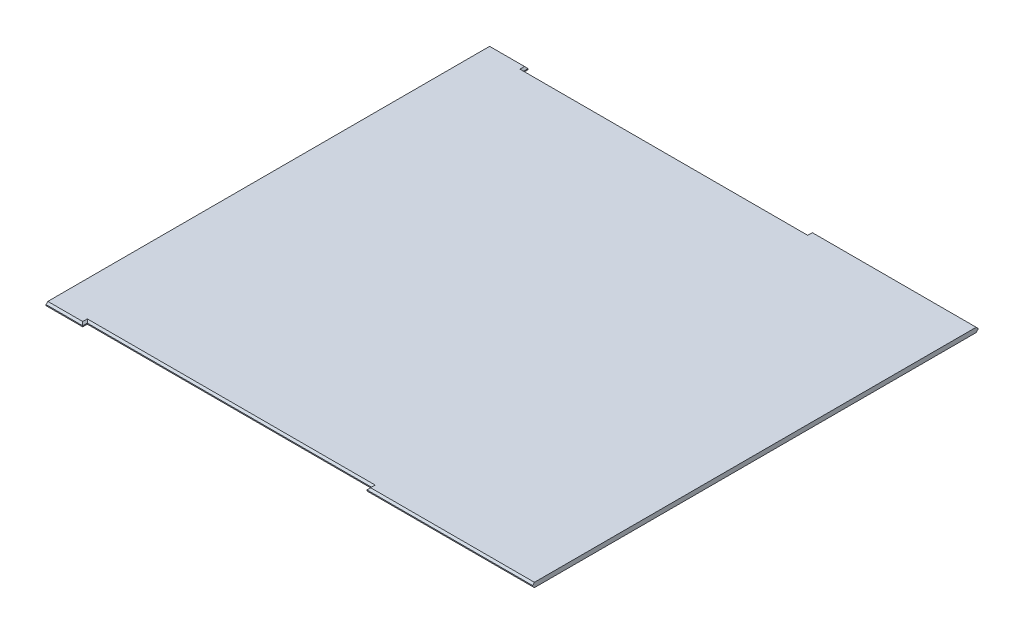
ISO-10303-21;
HEADER;
FILE_DESCRIPTION(('STEP AP214'),'2;1');
FILE_NAME('part.step','',(''),(''),'','','');
FILE_SCHEMA(('AUTOMOTIVE_DESIGN { 1 0 10303 214 1 1 1 1 }'));
ENDSEC;
DATA;
#1=APPLICATION_CONTEXT('core data for automotive mechanical design processes');
#2=APPLICATION_PROTOCOL_DEFINITION('international standard','automotive_design',2000,#1);
#3=PRODUCT_CONTEXT('',#1,'mechanical');
#4=PRODUCT('Part','Part','',(#3));
#5=PRODUCT_RELATED_PRODUCT_CATEGORY('part','',(#4));
#6=PRODUCT_DEFINITION_FORMATION('','',#4);
#7=PRODUCT_DEFINITION_CONTEXT('part definition',#1,'design');
#8=PRODUCT_DEFINITION('design','',#6,#7);
#9=PRODUCT_DEFINITION_SHAPE('','',#8);
#10=(LENGTH_UNIT() NAMED_UNIT(*) SI_UNIT(.MILLI.,.METRE.));
#11=(NAMED_UNIT(*) PLANE_ANGLE_UNIT() SI_UNIT($,.RADIAN.));
#12=(NAMED_UNIT(*) SI_UNIT($,.STERADIAN.) SOLID_ANGLE_UNIT());
#13=UNCERTAINTY_MEASURE_WITH_UNIT(LENGTH_MEASURE(1.E-05),#10,'distance_accuracy_value','');
#14=(GEOMETRIC_REPRESENTATION_CONTEXT(3) GLOBAL_UNCERTAINTY_ASSIGNED_CONTEXT((#13)) GLOBAL_UNIT_ASSIGNED_CONTEXT((#10,
#11,#12)) REPRESENTATION_CONTEXT('',''));
#15=CARTESIAN_POINT('',(0.,0.,0.));
#16=DIRECTION('',(0.,0.,1.));
#17=DIRECTION('',(1.,0.,0.));
#18=AXIS2_PLACEMENT_3D('',#15,#16,#17);
#19=CARTESIAN_POINT('',(-562.573544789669,6.35,-556.126720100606));
#20=DIRECTION('',(-1.,0.,0.));
#21=DIRECTION('',(0.,0.,1.));
#22=AXIS2_PLACEMENT_3D('',#19,#20,#21);
#23=PLANE('',#22);
#24=DIRECTION('',(0.,-1.,0.));
#25=VECTOR('',#24,1.);
#26=CARTESIAN_POINT('',(-562.573544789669,6.35,-556.126720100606));
#27=LINE('',#26,#25);
#28=CARTESIAN_POINT('',(-562.573544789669,1.34999999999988,-556.126720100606));
#29=VERTEX_POINT('',#28);
#30=CARTESIAN_POINT('',(-562.573544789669,-1.34999999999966,-556.126720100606));
#31=VERTEX_POINT('',#30);
#32=EDGE_CURVE('E462',#29,#31,#27,.T.);
#33=ORIENTED_EDGE('',*,*,#32,.T.);
#34=DIRECTION('',(0.,0.,-1.));
#35=VECTOR('',#34,1.);
#36=CARTESIAN_POINT('',(-562.573544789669,-1.34999999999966,-556.126720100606));
#37=LINE('',#36,#35);
#38=CARTESIAN_POINT('',(-562.573544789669,-1.34999999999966,-568.651720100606));
#39=VERTEX_POINT('',#38);
#40=EDGE_CURVE('E286',#31,#39,#37,.T.);
#41=ORIENTED_EDGE('',*,*,#40,.T.);
#42=DIRECTION('',(0.,-1.,0.));
#43=VECTOR('',#42,1.);
#44=CARTESIAN_POINT('',(-562.573544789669,6.35,-568.651720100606));
#45=LINE('',#44,#43);
#46=CARTESIAN_POINT('',(-562.573544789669,1.34999999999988,-568.651720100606));
#47=VERTEX_POINT('',#46);
#48=EDGE_CURVE('E232',#47,#39,#45,.T.);
#49=ORIENTED_EDGE('',*,*,#48,.F.);
#50=DIRECTION('',(0.,0.,1.));
#51=VECTOR('',#50,1.);
#52=CARTESIAN_POINT('',(-562.573544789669,1.34999999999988,-556.126720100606));
#53=LINE('',#52,#51);
#54=EDGE_CURVE('E287',#47,#29,#53,.T.);
#55=ORIENTED_EDGE('',*,*,#54,.T.);
#56=EDGE_LOOP('',(#33,#41,#49,#55));
#57=FACE_BOUND('',#56,.T.);
#58=ADVANCED_FACE('F50',(#57),#23,.F.);
#59=CARTESIAN_POINT('',(-562.573544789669,6.35,-568.651720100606));
#60=DIRECTION('',(0.,0.,1.));
#61=DIRECTION('',(1.,0.,0.));
#62=AXIS2_PLACEMENT_3D('',#59,#60,#61);
#63=PLANE('',#62);
#64=ORIENTED_EDGE('',*,*,#48,.T.);
#65=DIRECTION('',(-1.,0.,0.));
#66=VECTOR('',#65,1.);
#67=CARTESIAN_POINT('',(-562.573544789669,-1.34999999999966,-568.651720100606));
#68=LINE('',#67,#66);
#69=CARTESIAN_POINT('',(-662.573544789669,-1.34999999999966,-568.651720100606));
#70=VERTEX_POINT('',#69);
#71=EDGE_CURVE('E231',#39,#70,#68,.T.);
#72=ORIENTED_EDGE('',*,*,#71,.T.);
#73=DIRECTION('',(0.,-1.,0.));
#74=VECTOR('',#73,1.);
#75=CARTESIAN_POINT('',(-662.573544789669,6.35,-568.651720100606));
#76=LINE('',#75,#74);
#77=CARTESIAN_POINT('',(-662.573544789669,1.34999999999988,-568.651720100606));
#78=VERTEX_POINT('',#77);
#79=EDGE_CURVE('E213',#78,#70,#76,.T.);
#80=ORIENTED_EDGE('',*,*,#79,.F.);
#81=DIRECTION('',(1.,0.,0.));
#82=VECTOR('',#81,1.);
#83=CARTESIAN_POINT('',(-562.573544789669,1.34999999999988,-568.651720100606));
#84=LINE('',#83,#82);
#85=EDGE_CURVE('E229',#78,#47,#84,.T.);
#86=ORIENTED_EDGE('',*,*,#85,.T.);
#87=EDGE_LOOP('',(#64,#72,#80,#86));
#88=FACE_BOUND('',#87,.T.);
#89=ADVANCED_FACE('F230',(#88),#63,.F.);
#90=CARTESIAN_POINT('',(-662.573544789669,6.35,644.548279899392));
#91=DIRECTION('',(1.,0.,0.));
#92=DIRECTION('',(0.,0.,-1.));
#93=AXIS2_PLACEMENT_3D('',#90,#91,#92);
#94=PLANE('',#93);
#95=ORIENTED_EDGE('',*,*,#79,.T.);
#96=DIRECTION('',(0.,0.707106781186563,-0.707106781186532));
#97=VECTOR('',#96,1.);
#98=CARTESIAN_POINT('',(-662.573544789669,-1.34999999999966,-568.651720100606));
#99=LINE('',#98,#97);
#100=CARTESIAN_POINT('',(-662.573544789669,-6.35,-563.651720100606));
#101=VERTEX_POINT('',#100);
#102=EDGE_CURVE('E224',#70,#101,#99,.F.);
#103=ORIENTED_EDGE('',*,*,#102,.T.);
#104=DIRECTION('',(0.,0.,1.));
#105=VECTOR('',#104,1.);
#106=CARTESIAN_POINT('',(-662.573544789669,-6.35,644.548279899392));
#107=LINE('',#106,#105);
#108=CARTESIAN_POINT('',(-662.573544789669,-6.35,639.548279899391));
#109=VERTEX_POINT('',#108);
#110=EDGE_CURVE('E397',#101,#109,#107,.T.);
#111=ORIENTED_EDGE('',*,*,#110,.T.);
#112=DIRECTION('',(0.,-0.707106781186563,-0.707106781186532));
#113=VECTOR('',#112,1.);
#114=CARTESIAN_POINT('',(-662.573544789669,-1.34999999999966,644.548279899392));
#115=LINE('',#114,#113);
#116=CARTESIAN_POINT('',(-662.573544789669,-1.34999999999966,644.548279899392));
#117=VERTEX_POINT('',#116);
#118=EDGE_CURVE('E221',#109,#117,#115,.F.);
#119=ORIENTED_EDGE('',*,*,#118,.T.);
#120=DIRECTION('',(0.,-1.,0.));
#121=VECTOR('',#120,1.);
#122=CARTESIAN_POINT('',(-662.573544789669,6.35,644.548279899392));
#123=LINE('',#122,#121);
#124=CARTESIAN_POINT('',(-662.573544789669,1.34999999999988,644.548279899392));
#125=VERTEX_POINT('',#124);
#126=EDGE_CURVE('E236',#125,#117,#123,.T.);
#127=ORIENTED_EDGE('',*,*,#126,.F.);
#128=DIRECTION('',(0.,0.707106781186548,-0.707106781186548));
#129=VECTOR('',#128,1.);
#130=CARTESIAN_POINT('',(-662.573544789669,6.35,639.548279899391));
#131=LINE('',#130,#129);
#132=CARTESIAN_POINT('',(-662.573544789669,6.35,639.548279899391));
#133=VERTEX_POINT('',#132);
#134=EDGE_CURVE('E246',#125,#133,#131,.T.);
#135=ORIENTED_EDGE('',*,*,#134,.T.);
#136=DIRECTION('',(0.,0.,1.));
#137=VECTOR('',#136,1.);
#138=CARTESIAN_POINT('',(-662.573544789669,6.35,644.548279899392));
#139=LINE('',#138,#137);
#140=CARTESIAN_POINT('',(-662.573544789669,6.35,-563.651720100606));
#141=VERTEX_POINT('',#140);
#142=EDGE_CURVE('E220',#141,#133,#139,.T.);
#143=ORIENTED_EDGE('',*,*,#142,.F.);
#144=DIRECTION('',(0.,-0.707106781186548,-0.707106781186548));
#145=VECTOR('',#144,1.);
#146=CARTESIAN_POINT('',(-662.573544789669,6.35,-563.651720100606));
#147=LINE('',#146,#145);
#148=EDGE_CURVE('E215',#141,#78,#147,.T.);
#149=ORIENTED_EDGE('',*,*,#148,.T.);
#150=EDGE_LOOP('',(#95,#103,#111,#119,#127,#135,#143,#149));
#151=FACE_BOUND('',#150,.T.);
#152=ADVANCED_FACE('F211',(#151),#94,.F.);
#153=CARTESIAN_POINT('',(-562.573544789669,6.35,644.548279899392));
#154=DIRECTION('',(0.,0.,-1.));
#155=DIRECTION('',(-1.,0.,0.));
#156=AXIS2_PLACEMENT_3D('',#153,#154,#155);
#157=PLANE('',#156);
#158=ORIENTED_EDGE('',*,*,#126,.T.);
#159=DIRECTION('',(1.,0.,0.));
#160=VECTOR('',#159,1.);
#161=CARTESIAN_POINT('',(-562.573544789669,-1.34999999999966,644.548279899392));
#162=LINE('',#161,#160);
#163=CARTESIAN_POINT('',(-562.573544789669,-1.34999999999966,644.548279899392));
#164=VERTEX_POINT('',#163);
#165=EDGE_CURVE('E358',#117,#164,#162,.T.);
#166=ORIENTED_EDGE('',*,*,#165,.T.);
#167=DIRECTION('',(0.,-1.,0.));
#168=VECTOR('',#167,1.);
#169=CARTESIAN_POINT('',(-562.573544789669,6.35,644.548279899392));
#170=LINE('',#169,#168);
#171=CARTESIAN_POINT('',(-562.573544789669,1.34999999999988,644.548279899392));
#172=VERTEX_POINT('',#171);
#173=EDGE_CURVE('E499',#172,#164,#170,.T.);
#174=ORIENTED_EDGE('',*,*,#173,.F.);
#175=DIRECTION('',(-1.,0.,0.));
#176=VECTOR('',#175,1.);
#177=CARTESIAN_POINT('',(-662.573544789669,1.34999999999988,644.548279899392));
#178=LINE('',#177,#176);
#179=EDGE_CURVE('E354',#172,#125,#178,.T.);
#180=ORIENTED_EDGE('',*,*,#179,.T.);
#181=EDGE_LOOP('',(#158,#166,#174,#180));
#182=FACE_BOUND('',#181,.T.);
#183=ADVANCED_FACE('F508',(#182),#157,.F.);
#184=CARTESIAN_POINT('',(-562.573544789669,6.35,632.023279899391));
#185=DIRECTION('',(-1.,0.,0.));
#186=DIRECTION('',(0.,0.,1.));
#187=AXIS2_PLACEMENT_3D('',#184,#185,#186);
#188=PLANE('',#187);
#189=ORIENTED_EDGE('',*,*,#173,.T.);
#190=DIRECTION('',(0.,0.,-1.));
#191=VECTOR('',#190,1.);
#192=CARTESIAN_POINT('',(-562.573544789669,-1.34999999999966,632.023279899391));
#193=LINE('',#192,#191);
#194=CARTESIAN_POINT('',(-562.573544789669,-1.34999999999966,632.023279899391));
#195=VERTEX_POINT('',#194);
#196=EDGE_CURVE('E361',#164,#195,#193,.T.);
#197=ORIENTED_EDGE('',*,*,#196,.T.);
#198=DIRECTION('',(0.,-1.,0.));
#199=VECTOR('',#198,1.);
#200=CARTESIAN_POINT('',(-562.573544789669,6.35,632.023279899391));
#201=LINE('',#200,#199);
#202=CARTESIAN_POINT('',(-562.573544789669,1.34999999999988,632.023279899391));
#203=VERTEX_POINT('',#202);
#204=EDGE_CURVE('E496',#203,#195,#201,.T.);
#205=ORIENTED_EDGE('',*,*,#204,.F.);
#206=DIRECTION('',(0.,0.,1.));
#207=VECTOR('',#206,1.);
#208=CARTESIAN_POINT('',(-562.573544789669,1.34999999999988,644.548279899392));
#209=LINE('',#208,#207);
#210=EDGE_CURVE('E359',#203,#172,#209,.T.);
#211=ORIENTED_EDGE('',*,*,#210,.T.);
#212=EDGE_LOOP('',(#189,#197,#205,#211));
#213=FACE_BOUND('',#212,.T.);
#214=ADVANCED_FACE('F523',(#213),#188,.F.);
#215=CARTESIAN_POINT('',(211.426455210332,6.35,632.023279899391));
#216=DIRECTION('',(0.,0.,-1.));
#217=DIRECTION('',(-1.,0.,0.));
#218=AXIS2_PLACEMENT_3D('',#215,#216,#217);
#219=PLANE('',#218);
#220=ORIENTED_EDGE('',*,*,#204,.T.);
#221=DIRECTION('',(1.,0.,0.));
#222=VECTOR('',#221,1.);
#223=CARTESIAN_POINT('',(211.426455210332,-1.34999999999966,632.023279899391));
#224=LINE('',#223,#222);
#225=CARTESIAN_POINT('',(211.426455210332,-1.34999999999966,632.023279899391));
#226=VERTEX_POINT('',#225);
#227=EDGE_CURVE('E367',#195,#226,#224,.T.);
#228=ORIENTED_EDGE('',*,*,#227,.T.);
#229=DIRECTION('',(0.,-1.,0.));
#230=VECTOR('',#229,1.);
#231=CARTESIAN_POINT('',(211.426455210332,6.35,632.023279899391));
#232=LINE('',#231,#230);
#233=CARTESIAN_POINT('',(211.426455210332,1.34999999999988,632.023279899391));
#234=VERTEX_POINT('',#233);
#235=EDGE_CURVE('E491',#234,#226,#232,.T.);
#236=ORIENTED_EDGE('',*,*,#235,.F.);
#237=DIRECTION('',(-1.,0.,0.));
#238=VECTOR('',#237,1.);
#239=CARTESIAN_POINT('',(-562.573544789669,1.34999999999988,632.023279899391));
#240=LINE('',#239,#238);
#241=EDGE_CURVE('E366',#234,#203,#240,.T.);
#242=ORIENTED_EDGE('',*,*,#241,.T.);
#243=EDGE_LOOP('',(#220,#228,#236,#242));
#244=FACE_BOUND('',#243,.T.);
#245=ADVANCED_FACE('F526',(#244),#219,.F.);
#246=CARTESIAN_POINT('',(211.426455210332,6.35,632.023279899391));
#247=DIRECTION('',(1.,0.,0.));
#248=DIRECTION('',(0.,0.,-1.));
#249=AXIS2_PLACEMENT_3D('',#246,#247,#248);
#250=PLANE('',#249);
#251=ORIENTED_EDGE('',*,*,#235,.T.);
#252=DIRECTION('',(0.,0.,1.));
#253=VECTOR('',#252,1.);
#254=CARTESIAN_POINT('',(211.426455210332,-1.34999999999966,632.023279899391));
#255=LINE('',#254,#253);
#256=CARTESIAN_POINT('',(211.426455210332,-1.34999999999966,644.548279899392));
#257=VERTEX_POINT('',#256);
#258=EDGE_CURVE('E67',#226,#257,#255,.T.);
#259=ORIENTED_EDGE('',*,*,#258,.T.);
#260=DIRECTION('',(0.,-1.,0.));
#261=VECTOR('',#260,1.);
#262=CARTESIAN_POINT('',(211.426455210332,6.35,644.548279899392));
#263=LINE('',#262,#261);
#264=CARTESIAN_POINT('',(211.426455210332,1.34999999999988,644.548279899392));
#265=VERTEX_POINT('',#264);
#266=EDGE_CURVE('E489',#265,#257,#263,.T.);
#267=ORIENTED_EDGE('',*,*,#266,.F.);
#268=DIRECTION('',(0.,0.,-1.));
#269=VECTOR('',#268,1.);
#270=CARTESIAN_POINT('',(211.426455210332,1.34999999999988,632.023279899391));
#271=LINE('',#270,#269);
#272=EDGE_CURVE('E375',#265,#234,#271,.T.);
#273=ORIENTED_EDGE('',*,*,#272,.T.);
#274=EDGE_LOOP('',(#251,#259,#267,#273));
#275=FACE_BOUND('',#274,.T.);
#276=ADVANCED_FACE('F839',(#275),#250,.F.);
#277=CARTESIAN_POINT('',(211.426455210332,6.35,644.548279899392));
#278=DIRECTION('',(0.,0.,-1.));
#279=DIRECTION('',(-1.,0.,0.));
#280=AXIS2_PLACEMENT_3D('',#277,#278,#279);
#281=PLANE('',#280);
#282=ORIENTED_EDGE('',*,*,#266,.T.);
#283=DIRECTION('',(1.,0.,0.));
#284=VECTOR('',#283,1.);
#285=CARTESIAN_POINT('',(211.426455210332,-1.34999999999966,644.548279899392));
#286=LINE('',#285,#284);
#287=CARTESIAN_POINT('',(662.626455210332,-1.34999999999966,644.548279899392));
#288=VERTEX_POINT('',#287);
#289=EDGE_CURVE('E11',#257,#288,#286,.T.);
#290=ORIENTED_EDGE('',*,*,#289,.T.);
#291=DIRECTION('',(0.,-1.,0.));
#292=VECTOR('',#291,1.);
#293=CARTESIAN_POINT('',(662.626455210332,6.35,644.548279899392));
#294=LINE('',#293,#292);
#295=CARTESIAN_POINT('',(662.626455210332,1.34999999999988,644.548279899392));
#296=VERTEX_POINT('',#295);
#297=EDGE_CURVE('E487',#296,#288,#294,.T.);
#298=ORIENTED_EDGE('',*,*,#297,.F.);
#299=DIRECTION('',(-1.,0.,0.));
#300=VECTOR('',#299,1.);
#301=CARTESIAN_POINT('',(211.426455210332,1.34999999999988,644.548279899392));
#302=LINE('',#301,#300);
#303=EDGE_CURVE('E59',#296,#265,#302,.T.);
#304=ORIENTED_EDGE('',*,*,#303,.T.);
#305=EDGE_LOOP('',(#282,#290,#298,#304));
#306=FACE_BOUND('',#305,.T.);
#307=ADVANCED_FACE('F541',(#306),#281,.F.);
#308=CARTESIAN_POINT('',(662.626455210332,6.35,644.548279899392));
#309=DIRECTION('',(-1.,0.,0.));
#310=DIRECTION('',(0.,0.,1.));
#311=AXIS2_PLACEMENT_3D('',#308,#309,#310);
#312=PLANE('',#311);
#313=DIRECTION('',(0.,0.,-1.));
#314=VECTOR('',#313,1.);
#315=CARTESIAN_POINT('',(662.626455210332,-6.35,644.548279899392));
#316=LINE('',#315,#314);
#317=CARTESIAN_POINT('',(662.626455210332,-6.35,639.548279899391));
#318=VERTEX_POINT('',#317);
#319=CARTESIAN_POINT('',(662.626455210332,-6.35,-563.651720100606));
#320=VERTEX_POINT('',#319);
#321=EDGE_CURVE('E466',#318,#320,#316,.T.);
#322=ORIENTED_EDGE('',*,*,#321,.T.);
#323=DIRECTION('',(0.,-0.707106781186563,0.707106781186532));
#324=VECTOR('',#323,1.);
#325=CARTESIAN_POINT('',(662.626455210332,-1.34999999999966,-568.651720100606));
#326=LINE('',#325,#324);
#327=CARTESIAN_POINT('',(662.626455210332,-1.34999999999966,-568.651720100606));
#328=VERTEX_POINT('',#327);
#329=EDGE_CURVE('E316',#320,#328,#326,.F.);
#330=ORIENTED_EDGE('',*,*,#329,.T.);
#331=DIRECTION('',(0.,-1.,0.));
#332=VECTOR('',#331,1.);
#333=CARTESIAN_POINT('',(662.626455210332,6.35,-568.651720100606));
#334=LINE('',#333,#332);
#335=CARTESIAN_POINT('',(662.626455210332,1.34999999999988,-568.651720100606));
#336=VERTEX_POINT('',#335);
#337=EDGE_CURVE('E484',#336,#328,#334,.T.);
#338=ORIENTED_EDGE('',*,*,#337,.F.);
#339=DIRECTION('',(0.,0.707106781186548,0.707106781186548));
#340=VECTOR('',#339,1.);
#341=CARTESIAN_POINT('',(662.626455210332,6.35,-563.651720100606));
#342=LINE('',#341,#340);
#343=CARTESIAN_POINT('',(662.626455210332,6.35,-563.651720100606));
#344=VERTEX_POINT('',#343);
#345=EDGE_CURVE('E317',#336,#344,#342,.T.);
#346=ORIENTED_EDGE('',*,*,#345,.T.);
#347=DIRECTION('',(0.,0.,-1.));
#348=VECTOR('',#347,1.);
#349=CARTESIAN_POINT('',(662.626455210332,6.35,644.548279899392));
#350=LINE('',#349,#348);
#351=CARTESIAN_POINT('',(662.626455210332,6.35,639.548279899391));
#352=VERTEX_POINT('',#351);
#353=EDGE_CURVE('E455',#352,#344,#350,.T.);
#354=ORIENTED_EDGE('',*,*,#353,.F.);
#355=DIRECTION('',(0.,-0.707106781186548,0.707106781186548));
#356=VECTOR('',#355,1.);
#357=CARTESIAN_POINT('',(662.626455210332,6.35,639.548279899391));
#358=LINE('',#357,#356);
#359=EDGE_CURVE('E309',#352,#296,#358,.T.);
#360=ORIENTED_EDGE('',*,*,#359,.T.);
#361=ORIENTED_EDGE('',*,*,#297,.T.);
#362=DIRECTION('',(0.,0.707106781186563,0.707106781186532));
#363=VECTOR('',#362,1.);
#364=CARTESIAN_POINT('',(662.626455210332,-1.34999999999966,644.548279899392));
#365=LINE('',#364,#363);
#366=EDGE_CURVE('E312',#288,#318,#365,.F.);
#367=ORIENTED_EDGE('',*,*,#366,.T.);
#368=EDGE_LOOP('',(#322,#330,#338,#346,#354,#360,#361,#367));
#369=FACE_BOUND('',#368,.T.);
#370=ADVANCED_FACE('F457',(#369),#312,.F.);
#371=CARTESIAN_POINT('',(211.426455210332,6.35,-568.651720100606));
#372=DIRECTION('',(0.,0.,1.));
#373=DIRECTION('',(1.,0.,0.));
#374=AXIS2_PLACEMENT_3D('',#371,#372,#373);
#375=PLANE('',#374);
#376=ORIENTED_EDGE('',*,*,#337,.T.);
#377=DIRECTION('',(-1.,0.,0.));
#378=VECTOR('',#377,1.);
#379=CARTESIAN_POINT('',(211.426455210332,-1.34999999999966,-568.651720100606));
#380=LINE('',#379,#378);
#381=CARTESIAN_POINT('',(211.426455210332,-1.34999999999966,-568.651720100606));
#382=VERTEX_POINT('',#381);
#383=EDGE_CURVE('E310',#328,#382,#380,.T.);
#384=ORIENTED_EDGE('',*,*,#383,.T.);
#385=DIRECTION('',(0.,-1.,0.));
#386=VECTOR('',#385,1.);
#387=CARTESIAN_POINT('',(211.426455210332,6.35,-568.651720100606));
#388=LINE('',#387,#386);
#389=CARTESIAN_POINT('',(211.426455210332,1.34999999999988,-568.651720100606));
#390=VERTEX_POINT('',#389);
#391=EDGE_CURVE('E476',#390,#382,#388,.T.);
#392=ORIENTED_EDGE('',*,*,#391,.F.);
#393=DIRECTION('',(1.,0.,0.));
#394=VECTOR('',#393,1.);
#395=CARTESIAN_POINT('',(662.626455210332,1.34999999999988,-568.651720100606));
#396=LINE('',#395,#394);
#397=EDGE_CURVE('E302',#390,#336,#396,.T.);
#398=ORIENTED_EDGE('',*,*,#397,.T.);
#399=EDGE_LOOP('',(#376,#384,#392,#398));
#400=FACE_BOUND('',#399,.T.);
#401=ADVANCED_FACE('F583',(#400),#375,.F.);
#402=CARTESIAN_POINT('',(211.426455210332,6.35,-556.126720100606));
#403=DIRECTION('',(1.,0.,0.));
#404=DIRECTION('',(0.,0.,-1.));
#405=AXIS2_PLACEMENT_3D('',#402,#403,#404);
#406=PLANE('',#405);
#407=ORIENTED_EDGE('',*,*,#391,.T.);
#408=DIRECTION('',(0.,0.,1.));
#409=VECTOR('',#408,1.);
#410=CARTESIAN_POINT('',(211.426455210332,-1.34999999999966,-556.126720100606));
#411=LINE('',#410,#409);
#412=CARTESIAN_POINT('',(211.426455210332,-1.34999999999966,-556.126720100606));
#413=VERTEX_POINT('',#412);
#414=EDGE_CURVE('E301',#382,#413,#411,.T.);
#415=ORIENTED_EDGE('',*,*,#414,.T.);
#416=DIRECTION('',(0.,-1.,0.));
#417=VECTOR('',#416,1.);
#418=CARTESIAN_POINT('',(211.426455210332,6.35,-556.126720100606));
#419=LINE('',#418,#417);
#420=CARTESIAN_POINT('',(211.426455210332,1.34999999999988,-556.126720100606));
#421=VERTEX_POINT('',#420);
#422=EDGE_CURVE('E467',#421,#413,#419,.T.);
#423=ORIENTED_EDGE('',*,*,#422,.F.);
#424=DIRECTION('',(0.,0.,-1.));
#425=VECTOR('',#424,1.);
#426=CARTESIAN_POINT('',(211.426455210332,1.34999999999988,-568.651720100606));
#427=LINE('',#426,#425);
#428=EDGE_CURVE('E296',#421,#390,#427,.T.);
#429=ORIENTED_EDGE('',*,*,#428,.T.);
#430=EDGE_LOOP('',(#407,#415,#423,#429));
#431=FACE_BOUND('',#430,.T.);
#432=ADVANCED_FACE('F563',(#431),#406,.F.);
#433=CARTESIAN_POINT('',(211.426455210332,6.35,-556.126720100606));
#434=DIRECTION('',(0.,0.,1.));
#435=DIRECTION('',(1.,0.,0.));
#436=AXIS2_PLACEMENT_3D('',#433,#434,#435);
#437=PLANE('',#436);
#438=ORIENTED_EDGE('',*,*,#422,.T.);
#439=DIRECTION('',(-1.,0.,0.));
#440=VECTOR('',#439,1.);
#441=CARTESIAN_POINT('',(211.426455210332,-1.34999999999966,-556.126720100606));
#442=LINE('',#441,#440);
#443=EDGE_CURVE('E294',#413,#31,#442,.T.);
#444=ORIENTED_EDGE('',*,*,#443,.T.);
#445=ORIENTED_EDGE('',*,*,#32,.F.);
#446=DIRECTION('',(1.,0.,0.));
#447=VECTOR('',#446,1.);
#448=CARTESIAN_POINT('',(211.426455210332,1.34999999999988,-556.126720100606));
#449=LINE('',#448,#447);
#450=EDGE_CURVE('E292',#29,#421,#449,.T.);
#451=ORIENTED_EDGE('',*,*,#450,.T.);
#452=EDGE_LOOP('',(#438,#444,#445,#451));
#453=FACE_BOUND('',#452,.T.);
#454=ADVANCED_FACE('F570',(#453),#437,.F.);
#455=CARTESIAN_POINT('',(0.,6.35,0.));
#456=DIRECTION('',(0.,1.,0.));
#457=DIRECTION('',(0.,0.,1.));
#458=AXIS2_PLACEMENT_3D('',#455,#456,#457);
#459=PLANE('',#458);
#460=DIRECTION('',(0.,0.,-1.));
#461=VECTOR('',#460,1.);
#462=CARTESIAN_POINT('',(-567.573544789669,6.35,-568.651720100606));
#463=LINE('',#462,#461);
#464=CARTESIAN_POINT('',(-567.573544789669,6.35,-551.126720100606));
#465=VERTEX_POINT('',#464);
#466=CARTESIAN_POINT('',(-567.573544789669,6.35,-563.651720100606));
#467=VERTEX_POINT('',#466);
#468=EDGE_CURVE('E350',#465,#467,#463,.T.);
#469=ORIENTED_EDGE('',*,*,#468,.T.);
#470=DIRECTION('',(-1.,0.,0.));
#471=VECTOR('',#470,1.);
#472=CARTESIAN_POINT('',(-662.573544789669,6.35,-563.651720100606));
#473=LINE('',#472,#471);
#474=EDGE_CURVE('E348',#467,#141,#473,.T.);
#475=ORIENTED_EDGE('',*,*,#474,.T.);
#476=ORIENTED_EDGE('',*,*,#142,.T.);
#477=DIRECTION('',(1.,0.,0.));
#478=VECTOR('',#477,1.);
#479=CARTESIAN_POINT('',(-562.573544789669,6.35,639.548279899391));
#480=LINE('',#479,#478);
#481=CARTESIAN_POINT('',(-567.573544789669,6.35,639.548279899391));
#482=VERTEX_POINT('',#481);
#483=EDGE_CURVE('E331',#133,#482,#480,.T.);
#484=ORIENTED_EDGE('',*,*,#483,.T.);
#485=DIRECTION('',(0.,0.,-1.));
#486=VECTOR('',#485,1.);
#487=CARTESIAN_POINT('',(-567.573544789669,6.35,632.023279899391));
#488=LINE('',#487,#486);
#489=CARTESIAN_POINT('',(-567.573544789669,6.35,627.023279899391));
#490=VERTEX_POINT('',#489);
#491=EDGE_CURVE('E332',#482,#490,#488,.T.);
#492=ORIENTED_EDGE('',*,*,#491,.T.);
#493=DIRECTION('',(1.,0.,0.));
#494=VECTOR('',#493,1.);
#495=CARTESIAN_POINT('',(211.426455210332,6.35,627.023279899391));
#496=LINE('',#495,#494);
#497=CARTESIAN_POINT('',(216.426455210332,6.35,627.023279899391));
#498=VERTEX_POINT('',#497);
#499=EDGE_CURVE('E329',#490,#498,#496,.T.);
#500=ORIENTED_EDGE('',*,*,#499,.T.);
#501=DIRECTION('',(0.,0.,1.));
#502=VECTOR('',#501,1.);
#503=CARTESIAN_POINT('',(216.426455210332,6.35,644.548279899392));
#504=LINE('',#503,#502);
#505=CARTESIAN_POINT('',(216.426455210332,6.35,639.548279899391));
#506=VERTEX_POINT('',#505);
#507=EDGE_CURVE('E323',#498,#506,#504,.T.);
#508=ORIENTED_EDGE('',*,*,#507,.T.);
#509=DIRECTION('',(1.,0.,0.));
#510=VECTOR('',#509,1.);
#511=CARTESIAN_POINT('',(662.626455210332,6.35,639.548279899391));
#512=LINE('',#511,#510);
#513=EDGE_CURVE('E325',#506,#352,#512,.T.);
#514=ORIENTED_EDGE('',*,*,#513,.T.);
#515=ORIENTED_EDGE('',*,*,#353,.T.);
#516=DIRECTION('',(-1.,0.,0.));
#517=VECTOR('',#516,1.);
#518=CARTESIAN_POINT('',(211.426455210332,6.35,-563.651720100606));
#519=LINE('',#518,#517);
#520=CARTESIAN_POINT('',(216.426455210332,6.35,-563.651720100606));
#521=VERTEX_POINT('',#520);
#522=EDGE_CURVE('E342',#344,#521,#519,.T.);
#523=ORIENTED_EDGE('',*,*,#522,.T.);
#524=DIRECTION('',(0.,0.,1.));
#525=VECTOR('',#524,1.);
#526=CARTESIAN_POINT('',(216.426455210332,6.35,-556.126720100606));
#527=LINE('',#526,#525);
#528=CARTESIAN_POINT('',(216.426455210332,6.35,-551.126720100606));
#529=VERTEX_POINT('',#528);
#530=EDGE_CURVE('E336',#521,#529,#527,.T.);
#531=ORIENTED_EDGE('',*,*,#530,.T.);
#532=DIRECTION('',(-1.,0.,0.));
#533=VECTOR('',#532,1.);
#534=CARTESIAN_POINT('',(-562.573544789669,6.35,-551.126720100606));
#535=LINE('',#534,#533);
#536=EDGE_CURVE('E341',#529,#465,#535,.T.);
#537=ORIENTED_EDGE('',*,*,#536,.T.);
#538=EDGE_LOOP('',(#469,#475,#476,#484,#492,#500,#508,#514,#515,#523,#531,#537));
#539=FACE_BOUND('',#538,.T.);
#540=ADVANCED_FACE('F452',(#539),#459,.T.);
#541=CARTESIAN_POINT('',(0.,-6.35,0.));
#542=DIRECTION('',(0.,1.,0.));
#543=DIRECTION('',(0.,0.,1.));
#544=AXIS2_PLACEMENT_3D('',#541,#542,#543);
#545=PLANE('',#544);
#546=ORIENTED_EDGE('',*,*,#110,.F.);
#547=DIRECTION('',(1.,0.,0.));
#548=VECTOR('',#547,1.);
#549=CARTESIAN_POINT('',(0.,-6.35,-563.651720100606));
#550=LINE('',#549,#548);
#551=CARTESIAN_POINT('',(-567.573544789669,-6.35,-563.651720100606));
#552=VERTEX_POINT('',#551);
#553=EDGE_CURVE('E284',#101,#552,#550,.T.);
#554=ORIENTED_EDGE('',*,*,#553,.T.);
#555=DIRECTION('',(0.,0.,1.));
#556=VECTOR('',#555,1.);
#557=CARTESIAN_POINT('',(-567.573544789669,-6.35,0.));
#558=LINE('',#557,#556);
#559=CARTESIAN_POINT('',(-567.573544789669,-6.35,-551.126720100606));
#560=VERTEX_POINT('',#559);
#561=EDGE_CURVE('E278',#552,#560,#558,.T.);
#562=ORIENTED_EDGE('',*,*,#561,.T.);
#563=DIRECTION('',(1.,0.,0.));
#564=VECTOR('',#563,1.);
#565=CARTESIAN_POINT('',(0.,-6.35,-551.126720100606));
#566=LINE('',#565,#564);
#567=CARTESIAN_POINT('',(216.426455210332,-6.35,-551.126720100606));
#568=VERTEX_POINT('',#567);
#569=EDGE_CURVE('E280',#560,#568,#566,.T.);
#570=ORIENTED_EDGE('',*,*,#569,.T.);
#571=DIRECTION('',(0.,0.,-1.));
#572=VECTOR('',#571,1.);
#573=CARTESIAN_POINT('',(216.426455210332,-6.35,0.));
#574=LINE('',#573,#572);
#575=CARTESIAN_POINT('',(216.426455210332,-6.35,-563.651720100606));
#576=VERTEX_POINT('',#575);
#577=EDGE_CURVE('E274',#568,#576,#574,.T.);
#578=ORIENTED_EDGE('',*,*,#577,.T.);
#579=DIRECTION('',(1.,0.,0.));
#580=VECTOR('',#579,1.);
#581=CARTESIAN_POINT('',(0.,-6.35,-563.651720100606));
#582=LINE('',#581,#580);
#583=EDGE_CURVE('E272',#576,#320,#582,.T.);
#584=ORIENTED_EDGE('',*,*,#583,.T.);
#585=ORIENTED_EDGE('',*,*,#321,.F.);
#586=DIRECTION('',(-1.,0.,0.));
#587=VECTOR('',#586,1.);
#588=CARTESIAN_POINT('',(0.,-6.35,639.548279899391));
#589=LINE('',#588,#587);
#590=CARTESIAN_POINT('',(216.426455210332,-6.35,639.548279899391));
#591=VERTEX_POINT('',#590);
#592=EDGE_CURVE('E257',#318,#591,#589,.T.);
#593=ORIENTED_EDGE('',*,*,#592,.T.);
#594=DIRECTION('',(0.,0.,-1.));
#595=VECTOR('',#594,1.);
#596=CARTESIAN_POINT('',(216.426455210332,-6.35,0.));
#597=LINE('',#596,#595);
#598=CARTESIAN_POINT('',(216.426455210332,-6.35,627.023279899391));
#599=VERTEX_POINT('',#598);
#600=EDGE_CURVE('E256',#591,#599,#597,.T.);
#601=ORIENTED_EDGE('',*,*,#600,.T.);
#602=DIRECTION('',(-1.,0.,0.));
#603=VECTOR('',#602,1.);
#604=CARTESIAN_POINT('',(0.,-6.35,627.023279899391));
#605=LINE('',#604,#603);
#606=CARTESIAN_POINT('',(-567.573544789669,-6.35,627.023279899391));
#607=VERTEX_POINT('',#606);
#608=EDGE_CURVE('E265',#599,#607,#605,.T.);
#609=ORIENTED_EDGE('',*,*,#608,.T.);
#610=DIRECTION('',(0.,0.,1.));
#611=VECTOR('',#610,1.);
#612=CARTESIAN_POINT('',(-567.573544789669,-6.35,0.));
#613=LINE('',#612,#611);
#614=CARTESIAN_POINT('',(-567.573544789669,-6.35,639.548279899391));
#615=VERTEX_POINT('',#614);
#616=EDGE_CURVE('E263',#607,#615,#613,.T.);
#617=ORIENTED_EDGE('',*,*,#616,.T.);
#618=DIRECTION('',(-1.,0.,0.));
#619=VECTOR('',#618,1.);
#620=CARTESIAN_POINT('',(0.,-6.35,639.548279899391));
#621=LINE('',#620,#619);
#622=EDGE_CURVE('E269',#615,#109,#621,.T.);
#623=ORIENTED_EDGE('',*,*,#622,.T.);
#624=EDGE_LOOP('',(#546,#554,#562,#570,#578,#584,#585,#593,#601,#609,#617,#623));
#625=FACE_BOUND('',#624,.T.);
#626=ADVANCED_FACE('F546',(#625),#545,.F.);
#627=CARTESIAN_POINT('',(211.426455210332,-1.34999999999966,-568.651720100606));
#628=DIRECTION('',(0.,0.707106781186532,0.707106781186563));
#629=DIRECTION('',(-1.,0.,0.));
#630=AXIS2_PLACEMENT_3D('',#627,#628,#629);
#631=PLANE('',#630);
#632=ORIENTED_EDGE('',*,*,#329,.F.);
#633=ORIENTED_EDGE('',*,*,#583,.F.);
#634=DIRECTION('',(-0.577350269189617,0.577350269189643,-0.577350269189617));
#635=VECTOR('',#634,1.);
#636=CARTESIAN_POINT('',(211.426455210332,-1.34999999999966,-568.651720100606));
#637=LINE('',#636,#635);
#638=EDGE_CURVE('E395',#382,#576,#637,.F.);
#639=ORIENTED_EDGE('',*,*,#638,.F.);
#640=ORIENTED_EDGE('',*,*,#383,.F.);
#641=EDGE_LOOP('',(#632,#633,#639,#640));
#642=FACE_BOUND('',#641,.T.);
#643=ADVANCED_FACE('F555',(#642),#631,.F.);
#644=CARTESIAN_POINT('',(211.426455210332,-1.34999999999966,-556.126720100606));
#645=DIRECTION('',(0.707106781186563,0.707106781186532,0.));
#646=DIRECTION('',(0.,0.,1.));
#647=AXIS2_PLACEMENT_3D('',#644,#645,#646);
#648=PLANE('',#647);
#649=ORIENTED_EDGE('',*,*,#638,.T.);
#650=ORIENTED_EDGE('',*,*,#577,.F.);
#651=DIRECTION('',(-0.577350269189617,0.577350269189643,-0.577350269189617));
#652=VECTOR('',#651,1.);
#653=CARTESIAN_POINT('',(211.426455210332,-1.34999999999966,-556.126720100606));
#654=LINE('',#653,#652);
#655=EDGE_CURVE('E389',#413,#568,#654,.F.);
#656=ORIENTED_EDGE('',*,*,#655,.F.);
#657=ORIENTED_EDGE('',*,*,#414,.F.);
#658=EDGE_LOOP('',(#649,#650,#656,#657));
#659=FACE_BOUND('',#658,.T.);
#660=ADVANCED_FACE('F556',(#659),#648,.F.);
#661=CARTESIAN_POINT('',(211.426455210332,-1.34999999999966,-556.126720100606));
#662=DIRECTION('',(0.,0.707106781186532,0.707106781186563));
#663=DIRECTION('',(-1.,0.,0.));
#664=AXIS2_PLACEMENT_3D('',#661,#662,#663);
#665=PLANE('',#664);
#666=ORIENTED_EDGE('',*,*,#655,.T.);
#667=ORIENTED_EDGE('',*,*,#569,.F.);
#668=DIRECTION('',(0.577350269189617,0.577350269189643,-0.577350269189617));
#669=VECTOR('',#668,1.);
#670=CARTESIAN_POINT('',(-562.573544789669,-1.34999999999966,-556.126720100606));
#671=LINE('',#670,#669);
#672=EDGE_CURVE('E384',#31,#560,#671,.F.);
#673=ORIENTED_EDGE('',*,*,#672,.F.);
#674=ORIENTED_EDGE('',*,*,#443,.F.);
#675=EDGE_LOOP('',(#666,#667,#673,#674));
#676=FACE_BOUND('',#675,.T.);
#677=ADVANCED_FACE('F620',(#676),#665,.F.);
#678=CARTESIAN_POINT('',(-562.573544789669,-1.34999999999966,-556.126720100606));
#679=DIRECTION('',(-0.707106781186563,0.707106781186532,0.));
#680=DIRECTION('',(0.,0.,-1.));
#681=AXIS2_PLACEMENT_3D('',#678,#679,#680);
#682=PLANE('',#681);
#683=ORIENTED_EDGE('',*,*,#672,.T.);
#684=ORIENTED_EDGE('',*,*,#561,.F.);
#685=DIRECTION('',(0.577350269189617,0.577350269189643,-0.577350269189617));
#686=VECTOR('',#685,1.);
#687=CARTESIAN_POINT('',(-566.748544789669,-5.52499999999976,-564.476720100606));
#688=LINE('',#687,#686);
#689=EDGE_CURVE('E378',#39,#552,#688,.F.);
#690=ORIENTED_EDGE('',*,*,#689,.F.);
#691=ORIENTED_EDGE('',*,*,#40,.F.);
#692=EDGE_LOOP('',(#683,#684,#690,#691));
#693=FACE_BOUND('',#692,.T.);
#694=ADVANCED_FACE('F597',(#693),#682,.F.);
#695=CARTESIAN_POINT('',(-562.573544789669,-1.34999999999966,-568.651720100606));
#696=DIRECTION('',(0.,0.707106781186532,0.707106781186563));
#697=DIRECTION('',(-1.,0.,0.));
#698=AXIS2_PLACEMENT_3D('',#695,#696,#697);
#699=PLANE('',#698);
#700=ORIENTED_EDGE('',*,*,#689,.T.);
#701=ORIENTED_EDGE('',*,*,#553,.F.);
#702=ORIENTED_EDGE('',*,*,#102,.F.);
#703=ORIENTED_EDGE('',*,*,#71,.F.);
#704=EDGE_LOOP('',(#700,#701,#702,#703));
#705=FACE_BOUND('',#704,.T.);
#706=ADVANCED_FACE('F586',(#705),#699,.F.);
#707=CARTESIAN_POINT('',(0.,6.35,-563.651720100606));
#708=DIRECTION('',(0.,0.707106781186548,-0.707106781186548));
#709=DIRECTION('',(1.,0.,0.));
#710=AXIS2_PLACEMENT_3D('',#707,#708,#709);
#711=PLANE('',#710);
#712=ORIENTED_EDGE('',*,*,#345,.F.);
#713=ORIENTED_EDGE('',*,*,#397,.F.);
#714=DIRECTION('',(-0.577350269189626,-0.577350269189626,-0.577350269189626));
#715=VECTOR('',#714,1.);
#716=CARTESIAN_POINT('',(404.310361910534,194.233906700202,-375.767813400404));
#717=LINE('',#716,#715);
#718=EDGE_CURVE('E381',#521,#390,#717,.T.);
#719=ORIENTED_EDGE('',*,*,#718,.F.);
#720=ORIENTED_EDGE('',*,*,#522,.F.);
#721=EDGE_LOOP('',(#712,#713,#719,#720));
#722=FACE_BOUND('',#721,.T.);
#723=ADVANCED_FACE('F590',(#722),#711,.T.);
#724=CARTESIAN_POINT('',(216.426455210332,6.35,0.));
#725=DIRECTION('',(-0.707106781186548,0.707106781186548,0.));
#726=DIRECTION('',(0.,0.,-1.));
#727=AXIS2_PLACEMENT_3D('',#724,#725,#726);
#728=PLANE('',#727);
#729=ORIENTED_EDGE('',*,*,#718,.T.);
#730=ORIENTED_EDGE('',*,*,#428,.F.);
#731=DIRECTION('',(0.577350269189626,0.577350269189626,0.577350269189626));
#732=VECTOR('',#731,1.);
#733=CARTESIAN_POINT('',(144.284303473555,-65.7921517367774,-623.268871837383));
#734=LINE('',#733,#732);
#735=EDGE_CURVE('E404',#529,#421,#734,.F.);
#736=ORIENTED_EDGE('',*,*,#735,.F.);
#737=ORIENTED_EDGE('',*,*,#530,.F.);
#738=EDGE_LOOP('',(#729,#730,#736,#737));
#739=FACE_BOUND('',#738,.T.);
#740=ADVANCED_FACE('F585',(#739),#728,.T.);
#741=CARTESIAN_POINT('',(0.,6.35,-551.126720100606));
#742=DIRECTION('',(0.,0.707106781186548,-0.707106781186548));
#743=DIRECTION('',(1.,0.,0.));
#744=AXIS2_PLACEMENT_3D('',#741,#742,#743);
#745=PLANE('',#744);
#746=ORIENTED_EDGE('',*,*,#735,.T.);
#747=ORIENTED_EDGE('',*,*,#450,.F.);
#748=DIRECTION('',(-0.577350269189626,0.577350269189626,0.577350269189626));
#749=VECTOR('',#748,1.);
#750=CARTESIAN_POINT('',(-751.282451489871,190.058906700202,-367.417813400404));
#751=LINE('',#750,#749);
#752=EDGE_CURVE('E396',#465,#29,#751,.F.);
#753=ORIENTED_EDGE('',*,*,#752,.F.);
#754=ORIENTED_EDGE('',*,*,#536,.F.);
#755=EDGE_LOOP('',(#746,#747,#753,#754));
#756=FACE_BOUND('',#755,.T.);
#757=ADVANCED_FACE('F575',(#756),#745,.T.);
#758=CARTESIAN_POINT('',(-567.573544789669,6.35,0.));
#759=DIRECTION('',(0.707106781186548,0.707106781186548,0.));
#760=DIRECTION('',(0.,0.,1.));
#761=AXIS2_PLACEMENT_3D('',#758,#759,#760);
#762=PLANE('',#761);
#763=ORIENTED_EDGE('',*,*,#752,.T.);
#764=ORIENTED_EDGE('',*,*,#54,.F.);
#765=DIRECTION('',(-0.577350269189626,0.577350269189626,0.577350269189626));
#766=VECTOR('',#765,1.);
#767=CARTESIAN_POINT('',(-755.457451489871,194.233906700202,-375.767813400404));
#768=LINE('',#767,#766);
#769=EDGE_CURVE('E241',#467,#47,#768,.F.);
#770=ORIENTED_EDGE('',*,*,#769,.F.);
#771=ORIENTED_EDGE('',*,*,#468,.F.);
#772=EDGE_LOOP('',(#763,#764,#770,#771));
#773=FACE_BOUND('',#772,.T.);
#774=ADVANCED_FACE('F579',(#773),#762,.T.);
#775=CARTESIAN_POINT('',(0.,6.35,-563.651720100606));
#776=DIRECTION('',(0.,0.707106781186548,-0.707106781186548));
#777=DIRECTION('',(1.,0.,0.));
#778=AXIS2_PLACEMENT_3D('',#775,#776,#777);
#779=PLANE('',#778);
#780=ORIENTED_EDGE('',*,*,#769,.T.);
#781=ORIENTED_EDGE('',*,*,#85,.F.);
#782=ORIENTED_EDGE('',*,*,#148,.F.);
#783=ORIENTED_EDGE('',*,*,#474,.F.);
#784=EDGE_LOOP('',(#780,#781,#782,#783));
#785=FACE_BOUND('',#784,.T.);
#786=ADVANCED_FACE('F237',(#785),#779,.T.);
#787=CARTESIAN_POINT('',(211.426455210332,-1.34999999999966,644.548279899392));
#788=DIRECTION('',(0.,0.707106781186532,-0.707106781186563));
#789=DIRECTION('',(1.,0.,0.));
#790=AXIS2_PLACEMENT_3D('',#787,#788,#789);
#791=PLANE('',#790);
#792=ORIENTED_EDGE('',*,*,#366,.F.);
#793=ORIENTED_EDGE('',*,*,#289,.F.);
#794=DIRECTION('',(0.577350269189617,-0.577350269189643,-0.577350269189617));
#795=VECTOR('',#794,1.);
#796=CARTESIAN_POINT('',(211.426455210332,-1.34999999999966,644.548279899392));
#797=LINE('',#796,#795);
#798=EDGE_CURVE('E398',#591,#257,#797,.F.);
#799=ORIENTED_EDGE('',*,*,#798,.F.);
#800=ORIENTED_EDGE('',*,*,#592,.F.);
#801=EDGE_LOOP('',(#792,#793,#799,#800));
#802=FACE_BOUND('',#801,.T.);
#803=ADVANCED_FACE('F544',(#802),#791,.F.);
#804=CARTESIAN_POINT('',(211.426455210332,-1.34999999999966,632.023279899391));
#805=DIRECTION('',(0.707106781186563,0.707106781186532,0.));
#806=DIRECTION('',(0.,0.,1.));
#807=AXIS2_PLACEMENT_3D('',#804,#805,#806);
#808=PLANE('',#807);
#809=ORIENTED_EDGE('',*,*,#798,.T.);
#810=ORIENTED_EDGE('',*,*,#258,.F.);
#811=DIRECTION('',(0.577350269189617,-0.577350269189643,-0.577350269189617));
#812=VECTOR('',#811,1.);
#813=CARTESIAN_POINT('',(211.426455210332,-1.34999999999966,632.023279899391));
#814=LINE('',#813,#812);
#815=EDGE_CURVE('E419',#599,#226,#814,.F.);
#816=ORIENTED_EDGE('',*,*,#815,.F.);
#817=ORIENTED_EDGE('',*,*,#600,.F.);
#818=EDGE_LOOP('',(#809,#810,#816,#817));
#819=FACE_BOUND('',#818,.T.);
#820=ADVANCED_FACE('F540',(#819),#808,.F.);
#821=CARTESIAN_POINT('',(211.426455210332,-1.34999999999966,632.023279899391));
#822=DIRECTION('',(0.,0.707106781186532,-0.707106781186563));
#823=DIRECTION('',(1.,0.,0.));
#824=AXIS2_PLACEMENT_3D('',#821,#822,#823);
#825=PLANE('',#824);
#826=ORIENTED_EDGE('',*,*,#815,.T.);
#827=ORIENTED_EDGE('',*,*,#227,.F.);
#828=DIRECTION('',(-0.577350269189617,-0.577350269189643,-0.577350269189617));
#829=VECTOR('',#828,1.);
#830=CARTESIAN_POINT('',(-562.573544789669,-1.34999999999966,632.023279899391));
#831=LINE('',#830,#829);
#832=EDGE_CURVE('E411',#607,#195,#831,.F.);
#833=ORIENTED_EDGE('',*,*,#832,.F.);
#834=ORIENTED_EDGE('',*,*,#608,.F.);
#835=EDGE_LOOP('',(#826,#827,#833,#834));
#836=FACE_BOUND('',#835,.T.);
#837=ADVANCED_FACE('F535',(#836),#825,.F.);
#838=CARTESIAN_POINT('',(-562.573544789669,-1.34999999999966,632.023279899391));
#839=DIRECTION('',(-0.707106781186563,0.707106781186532,0.));
#840=DIRECTION('',(0.,0.,-1.));
#841=AXIS2_PLACEMENT_3D('',#838,#839,#840);
#842=PLANE('',#841);
#843=ORIENTED_EDGE('',*,*,#832,.T.);
#844=ORIENTED_EDGE('',*,*,#196,.F.);
#845=DIRECTION('',(-0.577350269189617,-0.577350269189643,-0.577350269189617));
#846=VECTOR('',#845,1.);
#847=CARTESIAN_POINT('',(-566.748544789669,-5.52499999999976,640.373279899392));
#848=LINE('',#847,#846);
#849=EDGE_CURVE('E412',#615,#164,#848,.F.);
#850=ORIENTED_EDGE('',*,*,#849,.F.);
#851=ORIENTED_EDGE('',*,*,#616,.F.);
#852=EDGE_LOOP('',(#843,#844,#850,#851));
#853=FACE_BOUND('',#852,.T.);
#854=ADVANCED_FACE('F522',(#853),#842,.F.);
#855=CARTESIAN_POINT('',(-562.573544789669,-1.34999999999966,644.548279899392));
#856=DIRECTION('',(0.,0.707106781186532,-0.707106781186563));
#857=DIRECTION('',(1.,0.,0.));
#858=AXIS2_PLACEMENT_3D('',#855,#856,#857);
#859=PLANE('',#858);
#860=ORIENTED_EDGE('',*,*,#118,.F.);
#861=ORIENTED_EDGE('',*,*,#622,.F.);
#862=ORIENTED_EDGE('',*,*,#849,.T.);
#863=ORIENTED_EDGE('',*,*,#165,.F.);
#864=EDGE_LOOP('',(#860,#861,#862,#863));
#865=FACE_BOUND('',#864,.T.);
#866=ADVANCED_FACE('F513',(#865),#859,.F.);
#867=CARTESIAN_POINT('',(0.,6.35,639.548279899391));
#868=DIRECTION('',(0.,0.707106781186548,0.707106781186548));
#869=DIRECTION('',(-1.,0.,0.));
#870=AXIS2_PLACEMENT_3D('',#867,#868,#869);
#871=PLANE('',#870);
#872=ORIENTED_EDGE('',*,*,#359,.F.);
#873=ORIENTED_EDGE('',*,*,#513,.F.);
#874=DIRECTION('',(-0.577350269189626,-0.577350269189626,0.577350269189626));
#875=VECTOR('',#874,1.);
#876=CARTESIAN_POINT('',(144.284303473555,-65.7921517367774,711.690431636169));
#877=LINE('',#876,#875);
#878=EDGE_CURVE('E55',#265,#506,#877,.F.);
#879=ORIENTED_EDGE('',*,*,#878,.F.);
#880=ORIENTED_EDGE('',*,*,#303,.F.);
#881=EDGE_LOOP('',(#872,#873,#879,#880));
#882=FACE_BOUND('',#881,.T.);
#883=ADVANCED_FACE('F49',(#882),#871,.T.);
#884=CARTESIAN_POINT('',(216.426455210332,6.35,0.));
#885=DIRECTION('',(-0.707106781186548,0.707106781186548,0.));
#886=DIRECTION('',(0.,0.,-1.));
#887=AXIS2_PLACEMENT_3D('',#884,#885,#886);
#888=PLANE('',#887);
#889=ORIENTED_EDGE('',*,*,#878,.T.);
#890=ORIENTED_EDGE('',*,*,#507,.F.);
#891=DIRECTION('',(-0.577350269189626,-0.577350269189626,0.577350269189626));
#892=VECTOR('',#891,1.);
#893=CARTESIAN_POINT('',(144.284303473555,-65.7921517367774,699.165431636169));
#894=LINE('',#893,#892);
#895=EDGE_CURVE('E431',#234,#498,#894,.F.);
#896=ORIENTED_EDGE('',*,*,#895,.F.);
#897=ORIENTED_EDGE('',*,*,#272,.F.);
#898=EDGE_LOOP('',(#889,#890,#896,#897));
#899=FACE_BOUND('',#898,.T.);
#900=ADVANCED_FACE('F443',(#899),#888,.T.);
#901=CARTESIAN_POINT('',(0.,6.35,627.023279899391));
#902=DIRECTION('',(0.,0.707106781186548,0.707106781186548));
#903=DIRECTION('',(-1.,0.,0.));
#904=AXIS2_PLACEMENT_3D('',#901,#902,#903);
#905=PLANE('',#904);
#906=ORIENTED_EDGE('',*,*,#895,.T.);
#907=ORIENTED_EDGE('',*,*,#499,.F.);
#908=DIRECTION('',(0.577350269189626,-0.577350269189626,0.577350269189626));
#909=VECTOR('',#908,1.);
#910=CARTESIAN_POINT('',(-776.581304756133,215.357759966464,418.015519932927));
#911=LINE('',#910,#909);
#912=EDGE_CURVE('E426',#203,#490,#911,.F.);
#913=ORIENTED_EDGE('',*,*,#912,.F.);
#914=ORIENTED_EDGE('',*,*,#241,.F.);
#915=EDGE_LOOP('',(#906,#907,#913,#914));
#916=FACE_BOUND('',#915,.T.);
#917=ADVANCED_FACE('F720',(#916),#905,.T.);
#918=CARTESIAN_POINT('',(-567.573544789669,6.35,0.));
#919=DIRECTION('',(0.707106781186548,0.707106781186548,0.));
#920=DIRECTION('',(0.,0.,1.));
#921=AXIS2_PLACEMENT_3D('',#918,#919,#920);
#922=PLANE('',#921);
#923=ORIENTED_EDGE('',*,*,#912,.T.);
#924=ORIENTED_EDGE('',*,*,#491,.F.);
#925=DIRECTION('',(0.577350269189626,-0.577350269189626,0.577350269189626));
#926=VECTOR('',#925,1.);
#927=CARTESIAN_POINT('',(-780.756304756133,219.532759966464,426.365519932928));
#928=LINE('',#927,#926);
#929=EDGE_CURVE('E424',#172,#482,#928,.F.);
#930=ORIENTED_EDGE('',*,*,#929,.F.);
#931=ORIENTED_EDGE('',*,*,#210,.F.);
#932=EDGE_LOOP('',(#923,#924,#930,#931));
#933=FACE_BOUND('',#932,.T.);
#934=ADVANCED_FACE('F721',(#933),#922,.T.);
#935=CARTESIAN_POINT('',(0.,6.35,639.548279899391));
#936=DIRECTION('',(0.,0.707106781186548,0.707106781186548));
#937=DIRECTION('',(-1.,0.,0.));
#938=AXIS2_PLACEMENT_3D('',#935,#936,#937);
#939=PLANE('',#938);
#940=ORIENTED_EDGE('',*,*,#134,.F.);
#941=ORIENTED_EDGE('',*,*,#179,.F.);
#942=ORIENTED_EDGE('',*,*,#929,.T.);
#943=ORIENTED_EDGE('',*,*,#483,.F.);
#944=EDGE_LOOP('',(#940,#941,#942,#943));
#945=FACE_BOUND('',#944,.T.);
#946=ADVANCED_FACE('F735',(#945),#939,.T.);
#947=CLOSED_SHELL('',(#58,#89,#152,#183,#214,#245,#276,#307,#370,#401,#432,#454,#540,#626,#643,
#660,#677,#694,#706,#723,#740,#757,#774,#786,#803,#820,#837,#854,#866,#883,#900,#917,#934,#946));
#948=MANIFOLD_SOLID_BREP('B2',#947);
#949=ADVANCED_BREP_SHAPE_REPRESENTATION('',(#18,#948),#14);
#950=SHAPE_DEFINITION_REPRESENTATION(#9,#949);
ENDSEC;
END-ISO-10303-21;
